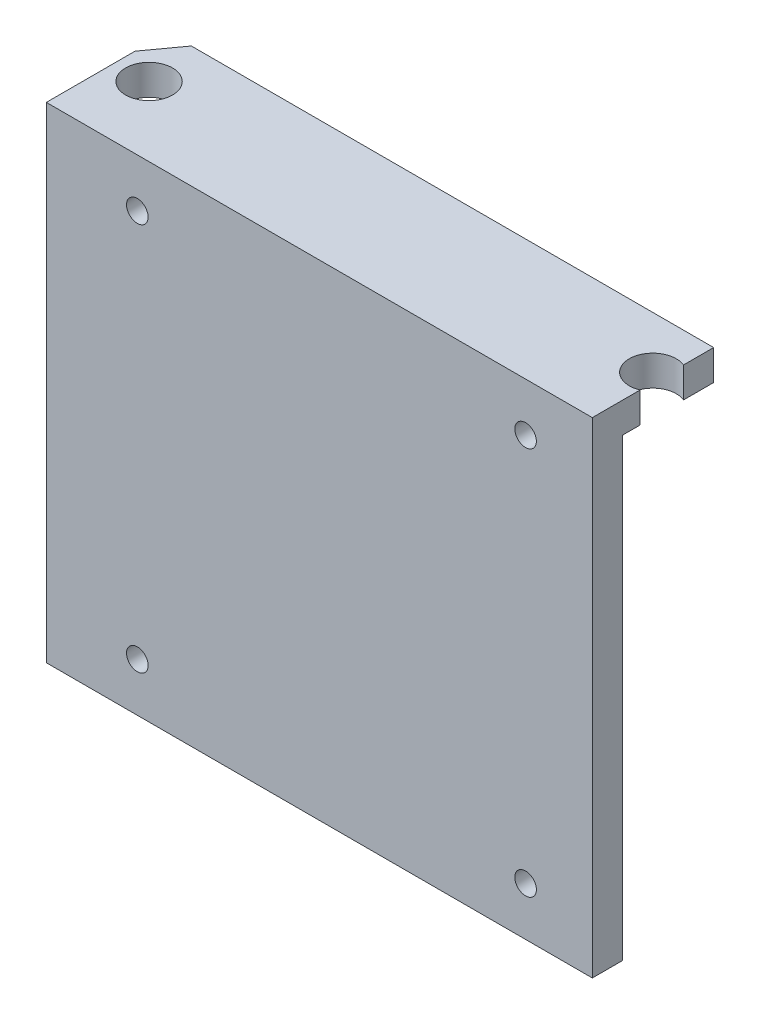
ISO-10303-21;
HEADER;
FILE_DESCRIPTION(('STEP AP214'),'2;1');
FILE_NAME('part.step','',(''),(''),'','','');
FILE_SCHEMA(('AUTOMOTIVE_DESIGN { 1 0 10303 214 1 1 1 1 }'));
ENDSEC;
DATA;
#1=APPLICATION_CONTEXT('core data for automotive mechanical design processes');
#2=APPLICATION_PROTOCOL_DEFINITION('international standard','automotive_design',2000,#1);
#3=PRODUCT_CONTEXT('',#1,'mechanical');
#4=PRODUCT('Part','Part','',(#3));
#5=PRODUCT_RELATED_PRODUCT_CATEGORY('part','',(#4));
#6=PRODUCT_DEFINITION_FORMATION('','',#4);
#7=PRODUCT_DEFINITION_CONTEXT('part definition',#1,'design');
#8=PRODUCT_DEFINITION('design','',#6,#7);
#9=PRODUCT_DEFINITION_SHAPE('','',#8);
#10=(LENGTH_UNIT() NAMED_UNIT(*) SI_UNIT(.MILLI.,.METRE.));
#11=(NAMED_UNIT(*) PLANE_ANGLE_UNIT() SI_UNIT($,.RADIAN.));
#12=(NAMED_UNIT(*) SI_UNIT($,.STERADIAN.) SOLID_ANGLE_UNIT());
#13=UNCERTAINTY_MEASURE_WITH_UNIT(LENGTH_MEASURE(1.E-05),#10,'distance_accuracy_value','');
#14=(GEOMETRIC_REPRESENTATION_CONTEXT(3) GLOBAL_UNCERTAINTY_ASSIGNED_CONTEXT((#13)) GLOBAL_UNIT_ASSIGNED_CONTEXT((#10,
#11,#12)) REPRESENTATION_CONTEXT('',''));
#15=CARTESIAN_POINT('',(0.,0.,0.));
#16=DIRECTION('',(0.,0.,1.));
#17=DIRECTION('',(1.,0.,0.));
#18=AXIS2_PLACEMENT_3D('',#15,#16,#17);
#19=CARTESIAN_POINT('',(33.655,0.,0.));
#20=DIRECTION('',(0.,-1.,0.));
#21=DIRECTION('',(0.,0.,-1.));
#22=AXIS2_PLACEMENT_3D('',#19,#20,#21);
#23=PLANE('',#22);
#24=CARTESIAN_POINT('',(-26.3621802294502,0.,-7.27090938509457));
#25=DIRECTION('',(0.,1.,0.));
#26=DIRECTION('',(0.,0.,1.));
#27=AXIS2_PLACEMENT_3D('',#24,#25,#26);
#28=CIRCLE('',#27,2.45745);
#29=CARTESIAN_POINT('',(-26.3621802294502,0.,-4.81345938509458));
#30=VERTEX_POINT('',#29);
#31=EDGE_CURVE('E269',#30,#30,#28,.T.);
#32=ORIENTED_EDGE('',*,*,#31,.F.);
#33=EDGE_LOOP('',(#32));
#34=FACE_BOUND('',#33,.T.);
#35=DIRECTION('',(-0.587785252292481,0.,0.809016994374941));
#36=VECTOR('',#35,1.);
#37=CARTESIAN_POINT('',(-27.3626049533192,0.,-12.7));
#38=LINE('',#37,#36);
#39=CARTESIAN_POINT('',(-27.3626049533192,0.,-12.7));
#40=VERTEX_POINT('',#39);
#41=CARTESIAN_POINT('',(-29.845,0.,-9.28327633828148));
#42=VERTEX_POINT('',#41);
#43=EDGE_CURVE('E257',#40,#42,#38,.T.);
#44=ORIENTED_EDGE('',*,*,#43,.T.);
#45=DIRECTION('',(0.,0.,1.));
#46=VECTOR('',#45,1.);
#47=CARTESIAN_POINT('',(-29.845,0.,-12.7));
#48=LINE('',#47,#46);
#49=CARTESIAN_POINT('',(-29.845,0.,0.));
#50=VERTEX_POINT('',#49);
#51=EDGE_CURVE('E71',#42,#50,#48,.T.);
#52=ORIENTED_EDGE('',*,*,#51,.T.);
#53=DIRECTION('',(-1.,0.,0.));
#54=VECTOR('',#53,1.);
#55=CARTESIAN_POINT('',(33.655,0.,0.));
#56=LINE('',#55,#54);
#57=CARTESIAN_POINT('',(27.305,0.,0.));
#58=VERTEX_POINT('',#57);
#59=EDGE_CURVE('E61',#58,#50,#56,.T.);
#60=ORIENTED_EDGE('',*,*,#59,.F.);
#61=DIRECTION('',(0.,0.,1.));
#62=VECTOR('',#61,1.);
#63=CARTESIAN_POINT('',(27.305,0.,-12.7));
#64=LINE('',#63,#62);
#65=CARTESIAN_POINT('',(27.305,0.,-5.00151488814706));
#66=VERTEX_POINT('',#65);
#67=EDGE_CURVE('E234',#66,#58,#64,.T.);
#68=ORIENTED_EDGE('',*,*,#67,.F.);
#69=CARTESIAN_POINT('',(26.362180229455,0.,-7.27090938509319));
#70=DIRECTION('',(0.,1.,0.));
#71=DIRECTION('',(0.,0.,1.));
#72=AXIS2_PLACEMENT_3D('',#69,#70,#71);
#73=CIRCLE('',#72,2.45745);
#74=CARTESIAN_POINT('',(27.305,0.,-9.54030388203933));
#75=VERTEX_POINT('',#74);
#76=EDGE_CURVE('E275',#75,#66,#73,.T.);
#77=ORIENTED_EDGE('',*,*,#76,.F.);
#78=CARTESIAN_POINT('',(27.305,0.,-12.7));
#79=VERTEX_POINT('',#78);
#80=EDGE_CURVE('E239',#79,#75,#64,.T.);
#81=ORIENTED_EDGE('',*,*,#80,.F.);
#82=DIRECTION('',(-1.,0.,0.));
#83=VECTOR('',#82,1.);
#84=CARTESIAN_POINT('',(27.3626049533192,0.,-12.7));
#85=LINE('',#84,#83);
#86=EDGE_CURVE('E255',#79,#40,#85,.T.);
#87=ORIENTED_EDGE('',*,*,#86,.T.);
#88=EDGE_LOOP('',(#44,#52,#60,#68,#77,#81,#87));
#89=FACE_BOUND('',#88,.T.);
#90=ADVANCED_FACE('F53',(#34,#89),#23,.F.);
#91=CARTESIAN_POINT('',(33.655,0.,0.));
#92=DIRECTION('',(0.,0.,-1.));
#93=DIRECTION('',(-1.,0.,0.));
#94=AXIS2_PLACEMENT_3D('',#91,#92,#93);
#95=PLANE('',#94);
#96=CARTESIAN_POINT('',(-20.32,-45.72,0.));
#97=DIRECTION('',(0.,0.,1.));
#98=DIRECTION('',(1.,0.,0.));
#99=AXIS2_PLACEMENT_3D('',#96,#97,#98);
#100=CIRCLE('',#99,1.1303);
#101=CARTESIAN_POINT('',(-19.1897,-45.72,0.));
#102=VERTEX_POINT('',#101);
#103=EDGE_CURVE('E194',#102,#102,#100,.T.);
#104=ORIENTED_EDGE('',*,*,#103,.F.);
#105=EDGE_LOOP('',(#104));
#106=FACE_BOUND('',#105,.T.);
#107=CARTESIAN_POINT('',(-20.32,-5.08,0.));
#108=DIRECTION('',(0.,0.,1.));
#109=DIRECTION('',(1.,0.,0.));
#110=AXIS2_PLACEMENT_3D('',#107,#108,#109);
#111=CIRCLE('',#110,1.1303);
#112=CARTESIAN_POINT('',(-19.1897,-5.08,0.));
#113=VERTEX_POINT('',#112);
#114=EDGE_CURVE('E177',#113,#113,#111,.T.);
#115=ORIENTED_EDGE('',*,*,#114,.F.);
#116=EDGE_LOOP('',(#115));
#117=FACE_BOUND('',#116,.T.);
#118=CARTESIAN_POINT('',(20.32,-5.08,0.));
#119=DIRECTION('',(0.,0.,1.));
#120=DIRECTION('',(1.,0.,0.));
#121=AXIS2_PLACEMENT_3D('',#118,#119,#120);
#122=CIRCLE('',#121,1.1303);
#123=CARTESIAN_POINT('',(21.4503,-5.08,0.));
#124=VERTEX_POINT('',#123);
#125=EDGE_CURVE('E176',#124,#124,#122,.T.);
#126=ORIENTED_EDGE('',*,*,#125,.F.);
#127=EDGE_LOOP('',(#126));
#128=FACE_BOUND('',#127,.T.);
#129=CARTESIAN_POINT('',(20.32,-45.72,0.));
#130=DIRECTION('',(0.,0.,1.));
#131=DIRECTION('',(1.,0.,0.));
#132=AXIS2_PLACEMENT_3D('',#129,#130,#131);
#133=CIRCLE('',#132,1.1303);
#134=CARTESIAN_POINT('',(21.4503,-45.72,0.));
#135=VERTEX_POINT('',#134);
#136=EDGE_CURVE('E201',#135,#135,#133,.T.);
#137=ORIENTED_EDGE('',*,*,#136,.F.);
#138=EDGE_LOOP('',(#137));
#139=FACE_BOUND('',#138,.T.);
#140=ORIENTED_EDGE('',*,*,#59,.T.);
#141=DIRECTION('',(0.,1.,0.));
#142=VECTOR('',#141,1.);
#143=CARTESIAN_POINT('',(-29.845,-50.8,0.));
#144=LINE('',#143,#142);
#145=CARTESIAN_POINT('',(-29.845,-50.8,0.));
#146=VERTEX_POINT('',#145);
#147=EDGE_CURVE('E142',#146,#50,#144,.T.);
#148=ORIENTED_EDGE('',*,*,#147,.F.);
#149=DIRECTION('',(-1.,0.,0.));
#150=VECTOR('',#149,1.);
#151=CARTESIAN_POINT('',(33.655,-50.8,0.));
#152=LINE('',#151,#150);
#153=CARTESIAN_POINT('',(27.305,-50.8,0.));
#154=VERTEX_POINT('',#153);
#155=EDGE_CURVE('E156',#154,#146,#152,.T.);
#156=ORIENTED_EDGE('',*,*,#155,.F.);
#157=DIRECTION('',(0.,-1.,0.));
#158=VECTOR('',#157,1.);
#159=CARTESIAN_POINT('',(27.305,0.,0.));
#160=LINE('',#159,#158);
#161=EDGE_CURVE('E224',#58,#154,#160,.T.);
#162=ORIENTED_EDGE('',*,*,#161,.F.);
#163=EDGE_LOOP('',(#140,#148,#156,#162));
#164=FACE_BOUND('',#163,.T.);
#165=ADVANCED_FACE('F154',(#106,#117,#128,#139,#164),#95,.F.);
#166=CARTESIAN_POINT('',(33.655,-50.8,-3.17500000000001));
#167=DIRECTION('',(0.,1.,0.));
#168=DIRECTION('',(0.,0.,1.));
#169=AXIS2_PLACEMENT_3D('',#166,#167,#168);
#170=PLANE('',#169);
#171=ORIENTED_EDGE('',*,*,#155,.T.);
#172=DIRECTION('',(0.,0.,1.));
#173=VECTOR('',#172,1.);
#174=CARTESIAN_POINT('',(-29.845,-50.8,-12.7));
#175=LINE('',#174,#173);
#176=CARTESIAN_POINT('',(-29.845,-50.8,-3.17500000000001));
#177=VERTEX_POINT('',#176);
#178=EDGE_CURVE('E139',#177,#146,#175,.T.);
#179=ORIENTED_EDGE('',*,*,#178,.F.);
#180=DIRECTION('',(-1.,0.,0.));
#181=VECTOR('',#180,1.);
#182=CARTESIAN_POINT('',(33.655,-50.8,-3.17500000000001));
#183=LINE('',#182,#181);
#184=CARTESIAN_POINT('',(27.305,-50.8,-3.175));
#185=VERTEX_POINT('',#184);
#186=EDGE_CURVE('E164',#185,#177,#183,.T.);
#187=ORIENTED_EDGE('',*,*,#186,.F.);
#188=DIRECTION('',(0.,0.,1.));
#189=VECTOR('',#188,1.);
#190=CARTESIAN_POINT('',(27.305,-50.8,-12.7));
#191=LINE('',#190,#189);
#192=EDGE_CURVE('E162',#185,#154,#191,.T.);
#193=ORIENTED_EDGE('',*,*,#192,.T.);
#194=EDGE_LOOP('',(#171,#179,#187,#193));
#195=FACE_BOUND('',#194,.T.);
#196=ADVANCED_FACE('F161',(#195),#170,.F.);
#197=CARTESIAN_POINT('',(33.655,-3.175,-3.175));
#198=DIRECTION('',(0.,0.,1.));
#199=DIRECTION('',(0.,-1.,0.));
#200=AXIS2_PLACEMENT_3D('',#197,#198,#199);
#201=PLANE('',#200);
#202=CARTESIAN_POINT('',(-20.32,-45.72,-3.17500000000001));
#203=DIRECTION('',(0.,0.,1.));
#204=DIRECTION('',(0.,-1.,0.));
#205=AXIS2_PLACEMENT_3D('',#202,#203,#204);
#206=CIRCLE('',#205,1.1303);
#207=CARTESIAN_POINT('',(-20.32,-46.8503,-3.17500000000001));
#208=VERTEX_POINT('',#207);
#209=EDGE_CURVE('E187',#208,#208,#206,.T.);
#210=ORIENTED_EDGE('',*,*,#209,.T.);
#211=EDGE_LOOP('',(#210));
#212=FACE_BOUND('',#211,.T.);
#213=CARTESIAN_POINT('',(-20.32,-5.08,-3.175));
#214=DIRECTION('',(0.,0.,1.));
#215=DIRECTION('',(0.,-1.,0.));
#216=AXIS2_PLACEMENT_3D('',#213,#214,#215);
#217=CIRCLE('',#216,1.1303);
#218=CARTESIAN_POINT('',(-20.32,-6.21029999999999,-3.175));
#219=VERTEX_POINT('',#218);
#220=EDGE_CURVE('E173',#219,#219,#217,.T.);
#221=ORIENTED_EDGE('',*,*,#220,.T.);
#222=EDGE_LOOP('',(#221));
#223=FACE_BOUND('',#222,.T.);
#224=CARTESIAN_POINT('',(20.32,-5.08,-3.175));
#225=DIRECTION('',(0.,0.,1.));
#226=DIRECTION('',(0.,-1.,0.));
#227=AXIS2_PLACEMENT_3D('',#224,#225,#226);
#228=CIRCLE('',#227,1.1303);
#229=CARTESIAN_POINT('',(20.32,-6.21029999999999,-3.175));
#230=VERTEX_POINT('',#229);
#231=EDGE_CURVE('E183',#230,#230,#228,.T.);
#232=ORIENTED_EDGE('',*,*,#231,.T.);
#233=EDGE_LOOP('',(#232));
#234=FACE_BOUND('',#233,.T.);
#235=CARTESIAN_POINT('',(20.32,-45.72,-3.17500000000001));
#236=DIRECTION('',(0.,0.,1.));
#237=DIRECTION('',(0.,-1.,0.));
#238=AXIS2_PLACEMENT_3D('',#235,#236,#237);
#239=CIRCLE('',#238,1.1303);
#240=CARTESIAN_POINT('',(20.32,-46.8503,-3.17500000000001));
#241=VERTEX_POINT('',#240);
#242=EDGE_CURVE('E205',#241,#241,#239,.T.);
#243=ORIENTED_EDGE('',*,*,#242,.T.);
#244=EDGE_LOOP('',(#243));
#245=FACE_BOUND('',#244,.T.);
#246=ORIENTED_EDGE('',*,*,#186,.T.);
#247=DIRECTION('',(0.,1.,0.));
#248=VECTOR('',#247,1.);
#249=CARTESIAN_POINT('',(-29.845,-3.17500000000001,-3.175));
#250=LINE('',#249,#248);
#251=CARTESIAN_POINT('',(-29.845,-3.175,-3.175));
#252=VERTEX_POINT('',#251);
#253=EDGE_CURVE('E144',#177,#252,#250,.T.);
#254=ORIENTED_EDGE('',*,*,#253,.T.);
#255=DIRECTION('',(-1.,0.,0.));
#256=VECTOR('',#255,1.);
#257=CARTESIAN_POINT('',(33.655,-3.175,-3.175));
#258=LINE('',#257,#256);
#259=CARTESIAN_POINT('',(27.305,-3.175,-3.175));
#260=VERTEX_POINT('',#259);
#261=EDGE_CURVE('E170',#260,#252,#258,.T.);
#262=ORIENTED_EDGE('',*,*,#261,.F.);
#263=DIRECTION('',(0.,-1.,0.));
#264=VECTOR('',#263,1.);
#265=CARTESIAN_POINT('',(27.305,-3.175,-3.175));
#266=LINE('',#265,#264);
#267=EDGE_CURVE('E222',#260,#185,#266,.T.);
#268=ORIENTED_EDGE('',*,*,#267,.T.);
#269=EDGE_LOOP('',(#246,#254,#262,#268));
#270=FACE_BOUND('',#269,.T.);
#271=ADVANCED_FACE('F221',(#212,#223,#234,#245,#270),#201,.F.);
#272=CARTESIAN_POINT('',(33.655,-3.175,-25.4));
#273=DIRECTION('',(0.,1.,0.));
#274=DIRECTION('',(0.,0.,1.));
#275=AXIS2_PLACEMENT_3D('',#272,#273,#274);
#276=PLANE('',#275);
#277=CARTESIAN_POINT('',(-26.3621802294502,-3.175,-7.27090938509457));
#278=DIRECTION('',(0.,1.,0.));
#279=DIRECTION('',(0.,0.,1.));
#280=AXIS2_PLACEMENT_3D('',#277,#278,#279);
#281=CIRCLE('',#280,2.45744999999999);
#282=CARTESIAN_POINT('',(-26.3621802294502,-3.175,-4.81345938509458));
#283=VERTEX_POINT('',#282);
#284=EDGE_CURVE('E272',#283,#283,#281,.T.);
#285=ORIENTED_EDGE('',*,*,#284,.T.);
#286=EDGE_LOOP('',(#285));
#287=FACE_BOUND('',#286,.T.);
#288=ORIENTED_EDGE('',*,*,#261,.T.);
#289=DIRECTION('',(0.,0.,-1.));
#290=VECTOR('',#289,1.);
#291=CARTESIAN_POINT('',(-29.845,-3.175,-25.4));
#292=LINE('',#291,#290);
#293=CARTESIAN_POINT('',(-29.845,-3.175,-9.28327633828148));
#294=VERTEX_POINT('',#293);
#295=EDGE_CURVE('E216',#252,#294,#292,.T.);
#296=ORIENTED_EDGE('',*,*,#295,.T.);
#297=DIRECTION('',(-0.587785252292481,0.,0.809016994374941));
#298=VECTOR('',#297,1.);
#299=CARTESIAN_POINT('',(-27.3626049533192,-3.175,-12.7));
#300=LINE('',#299,#298);
#301=CARTESIAN_POINT('',(-27.3626049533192,-3.175,-12.7));
#302=VERTEX_POINT('',#301);
#303=EDGE_CURVE('E258',#302,#294,#300,.T.);
#304=ORIENTED_EDGE('',*,*,#303,.F.);
#305=DIRECTION('',(-1.,0.,0.));
#306=VECTOR('',#305,1.);
#307=CARTESIAN_POINT('',(27.3626049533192,-3.175,-12.7));
#308=LINE('',#307,#306);
#309=CARTESIAN_POINT('',(27.305,-3.175,-12.7));
#310=VERTEX_POINT('',#309);
#311=EDGE_CURVE('E254',#310,#302,#308,.T.);
#312=ORIENTED_EDGE('',*,*,#311,.F.);
#313=DIRECTION('',(0.,0.,1.));
#314=VECTOR('',#313,1.);
#315=CARTESIAN_POINT('',(27.305,-3.175,-25.4));
#316=LINE('',#315,#314);
#317=CARTESIAN_POINT('',(27.305,-3.175,-9.54030388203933));
#318=VERTEX_POINT('',#317);
#319=EDGE_CURVE('E245',#310,#318,#316,.T.);
#320=ORIENTED_EDGE('',*,*,#319,.T.);
#321=CARTESIAN_POINT('',(26.362180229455,-3.175,-7.27090938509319));
#322=DIRECTION('',(0.,1.,0.));
#323=DIRECTION('',(0.,0.,1.));
#324=AXIS2_PLACEMENT_3D('',#321,#322,#323);
#325=CIRCLE('',#324,2.45745);
#326=CARTESIAN_POINT('',(27.305,-3.175,-5.00151488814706));
#327=VERTEX_POINT('',#326);
#328=EDGE_CURVE('E279',#318,#327,#325,.T.);
#329=ORIENTED_EDGE('',*,*,#328,.T.);
#330=EDGE_CURVE('E81',#327,#260,#316,.T.);
#331=ORIENTED_EDGE('',*,*,#330,.T.);
#332=EDGE_LOOP('',(#288,#296,#304,#312,#320,#329,#331));
#333=FACE_BOUND('',#332,.T.);
#334=ADVANCED_FACE('F214',(#287,#333),#276,.F.);
#335=CARTESIAN_POINT('',(20.32,-45.72,0.));
#336=DIRECTION('',(0.,0.,1.));
#337=DIRECTION('',(1.,0.,0.));
#338=AXIS2_PLACEMENT_3D('',#335,#336,#337);
#339=CYLINDRICAL_SURFACE('',#338,1.1303);
#340=ORIENTED_EDGE('',*,*,#136,.T.);
#341=EDGE_LOOP('',(#340));
#342=FACE_BOUND('',#341,.T.);
#343=ORIENTED_EDGE('',*,*,#242,.F.);
#344=EDGE_LOOP('',(#343));
#345=FACE_BOUND('',#344,.T.);
#346=ADVANCED_FACE('F295',(#342,#345),#339,.F.);
#347=CARTESIAN_POINT('',(20.32,-5.08,0.));
#348=DIRECTION('',(0.,0.,1.));
#349=DIRECTION('',(1.,0.,0.));
#350=AXIS2_PLACEMENT_3D('',#347,#348,#349);
#351=CYLINDRICAL_SURFACE('',#350,1.1303);
#352=ORIENTED_EDGE('',*,*,#125,.T.);
#353=EDGE_LOOP('',(#352));
#354=FACE_BOUND('',#353,.T.);
#355=ORIENTED_EDGE('',*,*,#231,.F.);
#356=EDGE_LOOP('',(#355));
#357=FACE_BOUND('',#356,.T.);
#358=ADVANCED_FACE('F298',(#354,#357),#351,.F.);
#359=CARTESIAN_POINT('',(-20.32,-5.08,0.));
#360=DIRECTION('',(0.,0.,1.));
#361=DIRECTION('',(1.,0.,0.));
#362=AXIS2_PLACEMENT_3D('',#359,#360,#361);
#363=CYLINDRICAL_SURFACE('',#362,1.1303);
#364=ORIENTED_EDGE('',*,*,#114,.T.);
#365=EDGE_LOOP('',(#364));
#366=FACE_BOUND('',#365,.T.);
#367=ORIENTED_EDGE('',*,*,#220,.F.);
#368=EDGE_LOOP('',(#367));
#369=FACE_BOUND('',#368,.T.);
#370=ADVANCED_FACE('F357',(#366,#369),#363,.F.);
#371=CARTESIAN_POINT('',(-20.32,-45.72,0.));
#372=DIRECTION('',(0.,0.,1.));
#373=DIRECTION('',(1.,0.,0.));
#374=AXIS2_PLACEMENT_3D('',#371,#372,#373);
#375=CYLINDRICAL_SURFACE('',#374,1.1303);
#376=ORIENTED_EDGE('',*,*,#103,.T.);
#377=EDGE_LOOP('',(#376));
#378=FACE_BOUND('',#377,.T.);
#379=ORIENTED_EDGE('',*,*,#209,.F.);
#380=EDGE_LOOP('',(#379));
#381=FACE_BOUND('',#380,.T.);
#382=ADVANCED_FACE('F285',(#378,#381),#375,.F.);
#383=CARTESIAN_POINT('',(26.362180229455,0.,-7.27090938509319));
#384=DIRECTION('',(0.,1.,0.));
#385=DIRECTION('',(0.,0.,1.));
#386=AXIS2_PLACEMENT_3D('',#383,#384,#385);
#387=CYLINDRICAL_SURFACE('',#386,2.45745);
#388=ORIENTED_EDGE('',*,*,#76,.T.);
#389=DIRECTION('',(0.,1.,0.));
#390=VECTOR('',#389,1.);
#391=CARTESIAN_POINT('',(27.305,0.,-5.00151488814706));
#392=LINE('',#391,#390);
#393=EDGE_CURVE('E249',#66,#327,#392,.F.);
#394=ORIENTED_EDGE('',*,*,#393,.T.);
#395=ORIENTED_EDGE('',*,*,#328,.F.);
#396=DIRECTION('',(0.,1.,0.));
#397=VECTOR('',#396,1.);
#398=CARTESIAN_POINT('',(27.305,0.,-9.54030388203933));
#399=LINE('',#398,#397);
#400=EDGE_CURVE('E238',#318,#75,#399,.T.);
#401=ORIENTED_EDGE('',*,*,#400,.T.);
#402=EDGE_LOOP('',(#388,#394,#395,#401));
#403=FACE_BOUND('',#402,.T.);
#404=ADVANCED_FACE('F333',(#403),#387,.F.);
#405=CARTESIAN_POINT('',(-26.3621802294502,0.,-7.27090938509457));
#406=DIRECTION('',(0.,1.,0.));
#407=DIRECTION('',(0.,0.,1.));
#408=AXIS2_PLACEMENT_3D('',#405,#406,#407);
#409=CYLINDRICAL_SURFACE('',#408,2.45744999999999);
#410=ORIENTED_EDGE('',*,*,#31,.T.);
#411=EDGE_LOOP('',(#410));
#412=FACE_BOUND('',#411,.T.);
#413=ORIENTED_EDGE('',*,*,#284,.F.);
#414=EDGE_LOOP('',(#413));
#415=FACE_BOUND('',#414,.T.);
#416=ADVANCED_FACE('F347',(#412,#415),#409,.F.);
#417=CARTESIAN_POINT('',(-27.3626049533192,0.,-12.7));
#418=DIRECTION('',(0.809016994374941,0.,0.587785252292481));
#419=DIRECTION('',(0.587785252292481,0.,-0.809016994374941));
#420=AXIS2_PLACEMENT_3D('',#417,#418,#419);
#421=PLANE('',#420);
#422=ORIENTED_EDGE('',*,*,#303,.T.);
#423=DIRECTION('',(0.,1.,0.));
#424=VECTOR('',#423,1.);
#425=CARTESIAN_POINT('',(-29.845,0.,-9.28327633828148));
#426=LINE('',#425,#424);
#427=EDGE_CURVE('E13',#294,#42,#426,.T.);
#428=ORIENTED_EDGE('',*,*,#427,.T.);
#429=ORIENTED_EDGE('',*,*,#43,.F.);
#430=DIRECTION('',(0.,-1.,0.));
#431=VECTOR('',#430,1.);
#432=CARTESIAN_POINT('',(-27.3626049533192,0.,-12.7));
#433=LINE('',#432,#431);
#434=EDGE_CURVE('E262',#40,#302,#433,.T.);
#435=ORIENTED_EDGE('',*,*,#434,.T.);
#436=EDGE_LOOP('',(#422,#428,#429,#435));
#437=FACE_BOUND('',#436,.T.);
#438=ADVANCED_FACE('F323',(#437),#421,.F.);
#439=CARTESIAN_POINT('',(27.3626049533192,0.,-12.7));
#440=DIRECTION('',(0.,0.,1.));
#441=DIRECTION('',(1.,0.,0.));
#442=AXIS2_PLACEMENT_3D('',#439,#440,#441);
#443=PLANE('',#442);
#444=ORIENTED_EDGE('',*,*,#86,.F.);
#445=DIRECTION('',(0.,-1.,0.));
#446=VECTOR('',#445,1.);
#447=CARTESIAN_POINT('',(27.305,0.,-12.7));
#448=LINE('',#447,#446);
#449=EDGE_CURVE('E227',#79,#310,#448,.T.);
#450=ORIENTED_EDGE('',*,*,#449,.T.);
#451=ORIENTED_EDGE('',*,*,#311,.T.);
#452=ORIENTED_EDGE('',*,*,#434,.F.);
#453=EDGE_LOOP('',(#444,#450,#451,#452));
#454=FACE_BOUND('',#453,.T.);
#455=ADVANCED_FACE('F327',(#454),#443,.F.);
#456=CARTESIAN_POINT('',(27.305,0.,-12.7));
#457=DIRECTION('',(-1.,0.,0.));
#458=DIRECTION('',(0.,-1.,0.));
#459=AXIS2_PLACEMENT_3D('',#456,#457,#458);
#460=PLANE('',#459);
#461=ORIENTED_EDGE('',*,*,#449,.F.);
#462=ORIENTED_EDGE('',*,*,#80,.T.);
#463=ORIENTED_EDGE('',*,*,#400,.F.);
#464=ORIENTED_EDGE('',*,*,#319,.F.);
#465=EDGE_LOOP('',(#461,#462,#463,#464));
#466=FACE_BOUND('',#465,.T.);
#467=ADVANCED_FACE('F329',(#466),#460,.F.);
#468=ORIENTED_EDGE('',*,*,#330,.F.);
#469=ORIENTED_EDGE('',*,*,#393,.F.);
#470=ORIENTED_EDGE('',*,*,#67,.T.);
#471=ORIENTED_EDGE('',*,*,#161,.T.);
#472=ORIENTED_EDGE('',*,*,#192,.F.);
#473=ORIENTED_EDGE('',*,*,#267,.F.);
#474=EDGE_LOOP('',(#468,#469,#470,#471,#472,#473));
#475=FACE_BOUND('',#474,.T.);
#476=ADVANCED_FACE('F334',(#475),#460,.F.);
#477=CARTESIAN_POINT('',(-29.845,-50.8,-12.7));
#478=DIRECTION('',(1.,0.,0.));
#479=DIRECTION('',(0.,1.,0.));
#480=AXIS2_PLACEMENT_3D('',#477,#478,#479);
#481=PLANE('',#480);
#482=ORIENTED_EDGE('',*,*,#178,.T.);
#483=ORIENTED_EDGE('',*,*,#147,.T.);
#484=ORIENTED_EDGE('',*,*,#51,.F.);
#485=ORIENTED_EDGE('',*,*,#427,.F.);
#486=ORIENTED_EDGE('',*,*,#295,.F.);
#487=ORIENTED_EDGE('',*,*,#253,.F.);
#488=EDGE_LOOP('',(#482,#483,#484,#485,#486,#487));
#489=FACE_BOUND('',#488,.T.);
#490=ADVANCED_FACE('F141',(#489),#481,.F.);
#491=CLOSED_SHELL('',(#90,#165,#196,#271,#334,#346,#358,#370,#382,#404,#416,#438,#455,#467,#476,#490));
#492=MANIFOLD_SOLID_BREP('B2',#491);
#493=ADVANCED_BREP_SHAPE_REPRESENTATION('',(#18,#492),#14);
#494=SHAPE_DEFINITION_REPRESENTATION(#9,#493);
ENDSEC;
END-ISO-10303-21;
